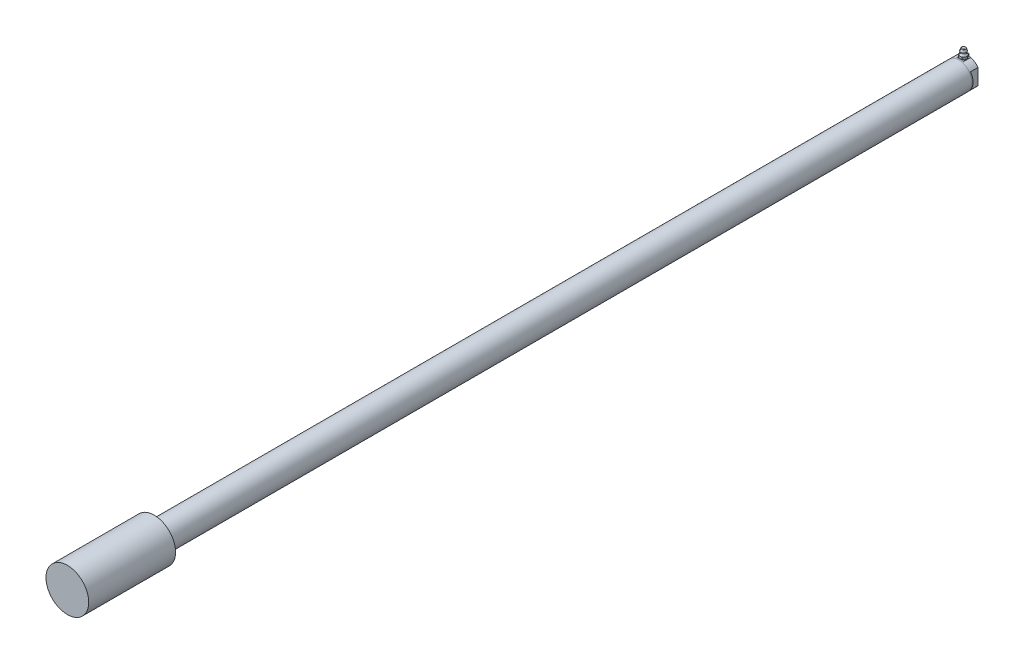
ISO-10303-21;
HEADER;
FILE_DESCRIPTION(('STEP AP214'),'2;1');
FILE_NAME('part.step','',(''),(''),'','','');
FILE_SCHEMA(('AUTOMOTIVE_DESIGN { 1 0 10303 214 1 1 1 1 }'));
ENDSEC;
DATA;
#1=APPLICATION_CONTEXT('core data for automotive mechanical design processes');
#2=APPLICATION_PROTOCOL_DEFINITION('international standard','automotive_design',2000,#1);
#3=PRODUCT_CONTEXT('',#1,'mechanical');
#4=PRODUCT('Part','Part','',(#3));
#5=PRODUCT_RELATED_PRODUCT_CATEGORY('part','',(#4));
#6=PRODUCT_DEFINITION_FORMATION('','',#4);
#7=PRODUCT_DEFINITION_CONTEXT('part definition',#1,'design');
#8=PRODUCT_DEFINITION('design','',#6,#7);
#9=PRODUCT_DEFINITION_SHAPE('','',#8);
#10=(LENGTH_UNIT() NAMED_UNIT(*) SI_UNIT(.MILLI.,.METRE.));
#11=(NAMED_UNIT(*) PLANE_ANGLE_UNIT() SI_UNIT($,.RADIAN.));
#12=(NAMED_UNIT(*) SI_UNIT($,.STERADIAN.) SOLID_ANGLE_UNIT());
#13=UNCERTAINTY_MEASURE_WITH_UNIT(LENGTH_MEASURE(1.E-05),#10,'distance_accuracy_value','');
#14=(GEOMETRIC_REPRESENTATION_CONTEXT(3) GLOBAL_UNCERTAINTY_ASSIGNED_CONTEXT((#13)) GLOBAL_UNIT_ASSIGNED_CONTEXT((#10,
#11,#12)) REPRESENTATION_CONTEXT('',''));
#15=CARTESIAN_POINT('',(0.,0.,0.));
#16=DIRECTION('',(0.,0.,1.));
#17=DIRECTION('',(1.,0.,0.));
#18=AXIS2_PLACEMENT_3D('',#15,#16,#17);
#19=CARTESIAN_POINT('',(0.,0.,10.16));
#20=DIRECTION('',(0.,0.,-1.));
#21=DIRECTION('',(-1.,0.,0.));
#22=AXIS2_PLACEMENT_3D('',#19,#20,#21);
#23=PLANE('',#22);
#24=CARTESIAN_POINT('',(0.,9.525,10.16));
#25=DIRECTION('',(0.,0.,-1.));
#26=DIRECTION('',(-1.,0.,0.));
#27=AXIS2_PLACEMENT_3D('',#24,#25,#26);
#28=CIRCLE('',#27,0.79375);
#29=CARTESIAN_POINT('',(-0.793749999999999,9.525,10.16));
#30=VERTEX_POINT('',#29);
#31=EDGE_CURVE('E26',#30,#30,#28,.T.);
#32=ORIENTED_EDGE('',*,*,#31,.T.);
#33=EDGE_LOOP('',(#32));
#34=FACE_BOUND('',#33,.T.);
#35=ADVANCED_FACE('F16',(#34),#23,.T.);
#36=CARTESIAN_POINT('',(0.,0.,979.1446));
#37=DIRECTION('',(0.,0.,-1.));
#38=DIRECTION('',(-1.,0.,0.));
#39=AXIS2_PLACEMENT_3D('',#36,#37,#38);
#40=CYLINDRICAL_SURFACE('',#39,15.8496);
#41=CARTESIAN_POINT('',(0.,0.,966.6986));
#42=DIRECTION('',(0.,0.,-1.));
#43=DIRECTION('',(-1.,0.,0.));
#44=AXIS2_PLACEMENT_3D('',#41,#42,#43);
#45=CIRCLE('',#44,15.8496);
#46=CARTESIAN_POINT('',(-15.8496,0.,966.6986));
#47=VERTEX_POINT('',#46);
#48=EDGE_CURVE('E433',#47,#47,#45,.F.);
#49=ORIENTED_EDGE('',*,*,#48,.F.);
#50=EDGE_LOOP('',(#49));
#51=FACE_BOUND('',#50,.T.);
#52=CARTESIAN_POINT('',(0.,0.,10.16));
#53=DIRECTION('',(0.,0.,-1.));
#54=DIRECTION('',(-1.,0.,0.));
#55=AXIS2_PLACEMENT_3D('',#52,#53,#54);
#56=CIRCLE('',#55,15.8496);
#57=CARTESIAN_POINT('',(-15.8496,0.,10.16));
#58=VERTEX_POINT('',#57);
#59=EDGE_CURVE('E436',#58,#58,#56,.T.);
#60=ORIENTED_EDGE('',*,*,#59,.F.);
#61=EDGE_LOOP('',(#60));
#62=FACE_BOUND('',#61,.T.);
#63=ADVANCED_FACE('F236',(#51,#62),#40,.T.);
#64=CARTESIAN_POINT('',(0.,0.,10.16));
#65=DIRECTION('',(0.,0.,-1.));
#66=DIRECTION('',(-1.,0.,0.));
#67=AXIS2_PLACEMENT_3D('',#64,#65,#66);
#68=CIRCLE('',#67,15.7607);
#69=CARTESIAN_POINT('',(-15.7607,0.,10.16));
#70=VERTEX_POINT('',#69);
#71=EDGE_CURVE('E10',#70,#70,#68,.T.);
#72=ORIENTED_EDGE('',*,*,#71,.F.);
#73=EDGE_LOOP('',(#72));
#74=FACE_BOUND('',#73,.T.);
#75=ORIENTED_EDGE('',*,*,#59,.T.);
#76=EDGE_LOOP('',(#75));
#77=FACE_BOUND('',#76,.T.);
#78=ADVANCED_FACE('F239',(#74,#77),#23,.T.);
#79=CARTESIAN_POINT('',(0.,0.,966.6986));
#80=DIRECTION('',(0.,0.,-1.));
#81=DIRECTION('',(-1.,0.,0.));
#82=AXIS2_PLACEMENT_3D('',#79,#80,#81);
#83=PLANE('',#82);
#84=ORIENTED_EDGE('',*,*,#48,.T.);
#85=EDGE_LOOP('',(#84));
#86=FACE_BOUND('',#85,.T.);
#87=CARTESIAN_POINT('',(0.,0.,966.6986));
#88=DIRECTION('',(0.,0.,-1.));
#89=DIRECTION('',(-1.,0.,0.));
#90=AXIS2_PLACEMENT_3D('',#87,#88,#89);
#91=CIRCLE('',#90,25.4);
#92=CARTESIAN_POINT('',(-25.4,0.,966.6986));
#93=VERTEX_POINT('',#92);
#94=EDGE_CURVE('E358',#93,#93,#91,.T.);
#95=ORIENTED_EDGE('',*,*,#94,.T.);
#96=EDGE_LOOP('',(#95));
#97=FACE_BOUND('',#96,.T.);
#98=ADVANCED_FACE('F249',(#86,#97),#83,.T.);
#99=CARTESIAN_POINT('',(0.,0.,1069.9496));
#100=DIRECTION('',(0.,0.,1.));
#101=DIRECTION('',(1.,0.,0.));
#102=AXIS2_PLACEMENT_3D('',#99,#100,#101);
#103=PLANE('',#102);
#104=CARTESIAN_POINT('',(0.,0.,1069.9496));
#105=DIRECTION('',(0.,0.,1.));
#106=DIRECTION('',(1.,0.,0.));
#107=AXIS2_PLACEMENT_3D('',#104,#105,#106);
#108=CIRCLE('',#107,25.4);
#109=CARTESIAN_POINT('',(25.4,0.,1069.9496));
#110=VERTEX_POINT('',#109);
#111=EDGE_CURVE('E439',#110,#110,#108,.T.);
#112=ORIENTED_EDGE('',*,*,#111,.T.);
#113=EDGE_LOOP('',(#112));
#114=FACE_BOUND('',#113,.T.);
#115=ADVANCED_FACE('F449',(#114),#103,.T.);
#116=CARTESIAN_POINT('',(0.,0.,1069.9496));
#117=DIRECTION('',(0.,0.,-1.));
#118=DIRECTION('',(-1.,0.,0.));
#119=AXIS2_PLACEMENT_3D('',#116,#117,#118);
#120=CYLINDRICAL_SURFACE('',#119,25.4);
#121=ORIENTED_EDGE('',*,*,#111,.F.);
#122=EDGE_LOOP('',(#121));
#123=FACE_BOUND('',#122,.T.);
#124=ORIENTED_EDGE('',*,*,#94,.F.);
#125=EDGE_LOOP('',(#124));
#126=FACE_BOUND('',#125,.T.);
#127=ADVANCED_FACE('F446',(#123,#126),#120,.T.);
#128=CARTESIAN_POINT('',(0.,25.4,4.445));
#129=DIRECTION('',(0.,1.,0.));
#130=DIRECTION('',(0.,0.,1.));
#131=AXIS2_PLACEMENT_3D('',#128,#129,#130);
#132=PLANE('',#131);
#133=CARTESIAN_POINT('',(0.,25.4,4.445));
#134=DIRECTION('',(0.,1.,0.));
#135=DIRECTION('',(0.,0.,1.));
#136=AXIS2_PLACEMENT_3D('',#133,#134,#135);
#137=CIRCLE('',#136,1.7474960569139);
#138=CARTESIAN_POINT('',(0.,25.4,6.1924960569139));
#139=VERTEX_POINT('',#138);
#140=EDGE_CURVE('E20',#139,#139,#137,.T.);
#141=ORIENTED_EDGE('',*,*,#140,.T.);
#142=EDGE_LOOP('',(#141));
#143=FACE_BOUND('',#142,.T.);
#144=ADVANCED_FACE('F448',(#143),#132,.T.);
#145=CARTESIAN_POINT('',(0.,24.638,4.445));
#146=DIRECTION('',(0.,1.,0.));
#147=DIRECTION('',(0.,0.,1.));
#148=AXIS2_PLACEMENT_3D('',#145,#146,#147);
#149=TOROIDAL_SURFACE('',#148,1.7474960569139,0.762);
#150=ORIENTED_EDGE('',*,*,#140,.F.);
#151=EDGE_LOOP('',(#150));
#152=FACE_BOUND('',#151,.T.);
#153=CARTESIAN_POINT('',(0.,24.8923915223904,4.445));
#154=DIRECTION('',(0.,1.,0.));
#155=DIRECTION('',(0.,0.,1.));
#156=AXIS2_PLACEMENT_3D('',#153,#154,#155);
#157=CIRCLE('',#156,2.46577800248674);
#158=CARTESIAN_POINT('',(0.,24.8923915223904,6.91077800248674));
#159=VERTEX_POINT('',#158);
#160=EDGE_CURVE('E423',#159,#159,#157,.F.);
#161=ORIENTED_EDGE('',*,*,#160,.F.);
#162=EDGE_LOOP('',(#161));
#163=FACE_BOUND('',#162,.T.);
#164=ADVANCED_FACE('F18',(#152,#163),#149,.T.);
#165=CARTESIAN_POINT('',(0.,22.352,4.445));
#166=DIRECTION('',(0.,-1.,0.));
#167=DIRECTION('',(0.,0.,-1.));
#168=AXIS2_PLACEMENT_3D('',#165,#166,#167);
#169=CONICAL_SURFACE('',#168,3.3655,0.340381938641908);
#170=ORIENTED_EDGE('',*,*,#160,.T.);
#171=EDGE_LOOP('',(#170));
#172=FACE_BOUND('',#171,.T.);
#173=CARTESIAN_POINT('',(0.,22.352,4.445));
#174=DIRECTION('',(0.,-1.,0.));
#175=DIRECTION('',(0.,0.,-1.));
#176=AXIS2_PLACEMENT_3D('',#173,#174,#175);
#177=CIRCLE('',#176,3.3655);
#178=CARTESIAN_POINT('',(0.,22.352,1.0795));
#179=VERTEX_POINT('',#178);
#180=EDGE_CURVE('E361',#179,#179,#177,.T.);
#181=ORIENTED_EDGE('',*,*,#180,.F.);
#182=EDGE_LOOP('',(#181));
#183=FACE_BOUND('',#182,.T.);
#184=ADVANCED_FACE('F266',(#172,#183),#169,.T.);
#185=CARTESIAN_POINT('',(0.,20.7536902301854,4.445));
#186=DIRECTION('',(0.,-1.,0.));
#187=DIRECTION('',(0.,0.,-1.));
#188=AXIS2_PLACEMENT_3D('',#185,#186,#187);
#189=TOROIDAL_SURFACE('',#188,5.20693450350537,2.43833450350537);
#190=ORIENTED_EDGE('',*,*,#180,.T.);
#191=EDGE_LOOP('',(#190));
#192=FACE_BOUND('',#191,.T.);
#193=CARTESIAN_POINT('',(0.,18.653125,4.445));
#194=DIRECTION('',(0.,-1.,0.));
#195=DIRECTION('',(0.,0.,-1.));
#196=AXIS2_PLACEMENT_3D('',#193,#194,#195);
#197=CIRCLE('',#196,3.96875);
#198=CARTESIAN_POINT('',(0.,18.653125,0.47625));
#199=VERTEX_POINT('',#198);
#200=CARTESIAN_POINT('',(3.43703832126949,18.653125,2.460625));
#201=VERTEX_POINT('',#200);
#202=EDGE_CURVE('E101',#199,#201,#197,.T.);
#203=ORIENTED_EDGE('',*,*,#202,.F.);
#204=CARTESIAN_POINT('',(-3.43703832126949,18.653125,2.460625));
#205=VERTEX_POINT('',#204);
#206=EDGE_CURVE('E364',#205,#199,#197,.T.);
#207=ORIENTED_EDGE('',*,*,#206,.F.);
#208=CARTESIAN_POINT('',(-3.43703832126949,18.653125,6.429375));
#209=VERTEX_POINT('',#208);
#210=EDGE_CURVE('E839',#209,#205,#197,.T.);
#211=ORIENTED_EDGE('',*,*,#210,.F.);
#212=CARTESIAN_POINT('',(0.,18.653125,8.41375));
#213=VERTEX_POINT('',#212);
#214=EDGE_CURVE('E836',#213,#209,#197,.T.);
#215=ORIENTED_EDGE('',*,*,#214,.F.);
#216=CARTESIAN_POINT('',(3.43703832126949,18.653125,6.429375));
#217=VERTEX_POINT('',#216);
#218=EDGE_CURVE('E835',#217,#213,#197,.T.);
#219=ORIENTED_EDGE('',*,*,#218,.F.);
#220=EDGE_CURVE('E94',#201,#217,#197,.T.);
#221=ORIENTED_EDGE('',*,*,#220,.F.);
#222=EDGE_LOOP('',(#203,#207,#211,#215,#219,#221));
#223=FACE_BOUND('',#222,.T.);
#224=ADVANCED_FACE('F457',(#192,#223),#189,.F.);
#225=CARTESIAN_POINT('',(-2.29135888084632,18.653125,0.47625));
#226=DIRECTION('',(0.,1.,0.));
#227=DIRECTION('',(1.,0.,0.));
#228=AXIS2_PLACEMENT_3D('',#225,#226,#227);
#229=PLANE('',#228);
#230=ORIENTED_EDGE('',*,*,#210,.T.);
#231=DIRECTION('',(-0.5,0.,0.866025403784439));
#232=VECTOR('',#231,1.);
#233=CARTESIAN_POINT('',(-2.29135888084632,18.653125,0.47625));
#234=LINE('',#233,#232);
#235=CARTESIAN_POINT('',(-4.58271776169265,18.653125,4.445));
#236=VERTEX_POINT('',#235);
#237=EDGE_CURVE('E375',#205,#236,#234,.T.);
#238=ORIENTED_EDGE('',*,*,#237,.T.);
#239=DIRECTION('',(0.5,0.,0.866025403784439));
#240=VECTOR('',#239,1.);
#241=CARTESIAN_POINT('',(-4.58271776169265,18.653125,4.445));
#242=LINE('',#241,#240);
#243=EDGE_CURVE('E381',#236,#209,#242,.T.);
#244=ORIENTED_EDGE('',*,*,#243,.T.);
#245=EDGE_LOOP('',(#230,#238,#244));
#246=FACE_BOUND('',#245,.T.);
#247=ADVANCED_FACE('F650',(#246),#229,.T.);
#248=ORIENTED_EDGE('',*,*,#214,.T.);
#249=CARTESIAN_POINT('',(-2.29135888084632,18.653125,8.41375));
#250=VERTEX_POINT('',#249);
#251=EDGE_CURVE('E380',#209,#250,#242,.T.);
#252=ORIENTED_EDGE('',*,*,#251,.T.);
#253=DIRECTION('',(1.,0.,0.));
#254=VECTOR('',#253,1.);
#255=CARTESIAN_POINT('',(-2.29135888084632,18.653125,8.41375));
#256=LINE('',#255,#254);
#257=EDGE_CURVE('E384',#250,#213,#256,.T.);
#258=ORIENTED_EDGE('',*,*,#257,.T.);
#259=EDGE_LOOP('',(#248,#252,#258));
#260=FACE_BOUND('',#259,.T.);
#261=ADVANCED_FACE('F262',(#260),#229,.T.);
#262=ORIENTED_EDGE('',*,*,#218,.T.);
#263=CARTESIAN_POINT('',(2.29135888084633,18.653125,8.41375));
#264=VERTEX_POINT('',#263);
#265=EDGE_CURVE('E383',#213,#264,#256,.T.);
#266=ORIENTED_EDGE('',*,*,#265,.T.);
#267=DIRECTION('',(0.5,0.,-0.866025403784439));
#268=VECTOR('',#267,1.);
#269=CARTESIAN_POINT('',(2.29135888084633,18.653125,8.41375));
#270=LINE('',#269,#268);
#271=EDGE_CURVE('E388',#264,#217,#270,.T.);
#272=ORIENTED_EDGE('',*,*,#271,.T.);
#273=EDGE_LOOP('',(#262,#266,#272));
#274=FACE_BOUND('',#273,.T.);
#275=ADVANCED_FACE('F726',(#274),#229,.T.);
#276=ORIENTED_EDGE('',*,*,#220,.T.);
#277=CARTESIAN_POINT('',(4.58271776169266,18.653125,4.445));
#278=VERTEX_POINT('',#277);
#279=EDGE_CURVE('E387',#217,#278,#270,.T.);
#280=ORIENTED_EDGE('',*,*,#279,.T.);
#281=DIRECTION('',(-0.5,0.,-0.866025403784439));
#282=VECTOR('',#281,1.);
#283=CARTESIAN_POINT('',(4.58271776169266,18.653125,4.445));
#284=LINE('',#283,#282);
#285=EDGE_CURVE('E392',#278,#201,#284,.T.);
#286=ORIENTED_EDGE('',*,*,#285,.T.);
#287=EDGE_LOOP('',(#276,#280,#286));
#288=FACE_BOUND('',#287,.T.);
#289=ADVANCED_FACE('F719',(#288),#229,.T.);
#290=ORIENTED_EDGE('',*,*,#202,.T.);
#291=CARTESIAN_POINT('',(2.29135888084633,18.653125,0.47625));
#292=VERTEX_POINT('',#291);
#293=EDGE_CURVE('E391',#201,#292,#284,.T.);
#294=ORIENTED_EDGE('',*,*,#293,.T.);
#295=DIRECTION('',(-1.,0.,0.));
#296=VECTOR('',#295,1.);
#297=CARTESIAN_POINT('',(2.29135888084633,18.653125,0.47625));
#298=LINE('',#297,#296);
#299=EDGE_CURVE('E373',#292,#199,#298,.T.);
#300=ORIENTED_EDGE('',*,*,#299,.T.);
#301=EDGE_LOOP('',(#290,#294,#300));
#302=FACE_BOUND('',#301,.T.);
#303=ADVANCED_FACE('F710',(#302),#229,.T.);
#304=ORIENTED_EDGE('',*,*,#206,.T.);
#305=CARTESIAN_POINT('',(-2.29135888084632,18.653125,0.47625));
#306=VERTEX_POINT('',#305);
#307=EDGE_CURVE('E376',#199,#306,#298,.T.);
#308=ORIENTED_EDGE('',*,*,#307,.T.);
#309=EDGE_CURVE('E377',#306,#205,#234,.T.);
#310=ORIENTED_EDGE('',*,*,#309,.T.);
#311=EDGE_LOOP('',(#304,#308,#310));
#312=FACE_BOUND('',#311,.T.);
#313=ADVANCED_FACE('F660',(#312),#229,.T.);
#314=CARTESIAN_POINT('',(-2.29135888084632,18.653125,0.47625));
#315=DIRECTION('',(0.866025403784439,0.,0.5));
#316=DIRECTION('',(0.5,0.,-0.866025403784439));
#317=AXIS2_PLACEMENT_3D('',#314,#315,#316);
#318=PLANE('',#317);
#319=DIRECTION('',(-0.5,0.,0.866025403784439));
#320=VECTOR('',#319,1.);
#321=CARTESIAN_POINT('',(-2.29135888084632,16.271875,0.47625));
#322=LINE('',#321,#320);
#323=CARTESIAN_POINT('',(-2.29135888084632,16.271875,0.47625));
#324=VERTEX_POINT('',#323);
#325=CARTESIAN_POINT('',(-4.58271776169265,16.271875,4.445));
#326=VERTEX_POINT('',#325);
#327=EDGE_CURVE('E397',#324,#326,#322,.T.);
#328=ORIENTED_EDGE('',*,*,#327,.T.);
#329=DIRECTION('',(0.,-1.,0.));
#330=VECTOR('',#329,1.);
#331=CARTESIAN_POINT('',(-4.58271776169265,18.653125,4.445));
#332=LINE('',#331,#330);
#333=EDGE_CURVE('E418',#236,#326,#332,.T.);
#334=ORIENTED_EDGE('',*,*,#333,.F.);
#335=ORIENTED_EDGE('',*,*,#237,.F.);
#336=ORIENTED_EDGE('',*,*,#309,.F.);
#337=DIRECTION('',(0.,-1.,0.));
#338=VECTOR('',#337,1.);
#339=CARTESIAN_POINT('',(-2.29135888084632,18.653125,0.47625));
#340=LINE('',#339,#338);
#341=EDGE_CURVE('E421',#306,#324,#340,.T.);
#342=ORIENTED_EDGE('',*,*,#341,.T.);
#343=EDGE_LOOP('',(#328,#334,#335,#336,#342));
#344=FACE_BOUND('',#343,.T.);
#345=ADVANCED_FACE('F659',(#344),#318,.F.);
#346=CARTESIAN_POINT('',(-4.58271776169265,18.653125,4.445));
#347=DIRECTION('',(0.866025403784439,0.,-0.5));
#348=DIRECTION('',(-0.5,0.,-0.866025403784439));
#349=AXIS2_PLACEMENT_3D('',#346,#347,#348);
#350=PLANE('',#349);
#351=DIRECTION('',(0.5,0.,0.866025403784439));
#352=VECTOR('',#351,1.);
#353=CARTESIAN_POINT('',(-4.58271776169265,16.271875,4.445));
#354=LINE('',#353,#352);
#355=CARTESIAN_POINT('',(-2.29135888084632,16.271875,8.41375));
#356=VERTEX_POINT('',#355);
#357=EDGE_CURVE('E399',#326,#356,#354,.T.);
#358=ORIENTED_EDGE('',*,*,#357,.T.);
#359=DIRECTION('',(0.,-1.,0.));
#360=VECTOR('',#359,1.);
#361=CARTESIAN_POINT('',(-2.29135888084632,18.653125,8.41375));
#362=LINE('',#361,#360);
#363=EDGE_CURVE('E415',#250,#356,#362,.T.);
#364=ORIENTED_EDGE('',*,*,#363,.F.);
#365=ORIENTED_EDGE('',*,*,#251,.F.);
#366=ORIENTED_EDGE('',*,*,#243,.F.);
#367=ORIENTED_EDGE('',*,*,#333,.T.);
#368=EDGE_LOOP('',(#358,#364,#365,#366,#367));
#369=FACE_BOUND('',#368,.T.);
#370=ADVANCED_FACE('F685',(#369),#350,.F.);
#371=CARTESIAN_POINT('',(-2.29135888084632,18.653125,8.41375));
#372=DIRECTION('',(0.,0.,-1.));
#373=DIRECTION('',(-1.,0.,0.));
#374=AXIS2_PLACEMENT_3D('',#371,#372,#373);
#375=PLANE('',#374);
#376=DIRECTION('',(1.,0.,0.));
#377=VECTOR('',#376,1.);
#378=CARTESIAN_POINT('',(-2.29135888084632,16.271875,8.41375));
#379=LINE('',#378,#377);
#380=CARTESIAN_POINT('',(2.29135888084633,16.271875,8.41375));
#381=VERTEX_POINT('',#380);
#382=EDGE_CURVE('E401',#356,#381,#379,.T.);
#383=ORIENTED_EDGE('',*,*,#382,.T.);
#384=DIRECTION('',(0.,-1.,0.));
#385=VECTOR('',#384,1.);
#386=CARTESIAN_POINT('',(2.29135888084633,18.653125,8.41375));
#387=LINE('',#386,#385);
#388=EDGE_CURVE('E412',#264,#381,#387,.T.);
#389=ORIENTED_EDGE('',*,*,#388,.F.);
#390=ORIENTED_EDGE('',*,*,#265,.F.);
#391=ORIENTED_EDGE('',*,*,#257,.F.);
#392=ORIENTED_EDGE('',*,*,#363,.T.);
#393=EDGE_LOOP('',(#383,#389,#390,#391,#392));
#394=FACE_BOUND('',#393,.T.);
#395=ADVANCED_FACE('F676',(#394),#375,.F.);
#396=CARTESIAN_POINT('',(2.29135888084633,18.653125,8.41375));
#397=DIRECTION('',(-0.866025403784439,0.,-0.5));
#398=DIRECTION('',(-0.5,0.,0.866025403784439));
#399=AXIS2_PLACEMENT_3D('',#396,#397,#398);
#400=PLANE('',#399);
#401=DIRECTION('',(0.5,0.,-0.866025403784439));
#402=VECTOR('',#401,1.);
#403=CARTESIAN_POINT('',(2.29135888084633,16.271875,8.41375));
#404=LINE('',#403,#402);
#405=CARTESIAN_POINT('',(4.58271776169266,16.271875,4.445));
#406=VERTEX_POINT('',#405);
#407=EDGE_CURVE('E403',#381,#406,#404,.T.);
#408=ORIENTED_EDGE('',*,*,#407,.T.);
#409=DIRECTION('',(0.,-1.,0.));
#410=VECTOR('',#409,1.);
#411=CARTESIAN_POINT('',(4.58271776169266,18.653125,4.445));
#412=LINE('',#411,#410);
#413=EDGE_CURVE('E409',#278,#406,#412,.T.);
#414=ORIENTED_EDGE('',*,*,#413,.F.);
#415=ORIENTED_EDGE('',*,*,#279,.F.);
#416=ORIENTED_EDGE('',*,*,#271,.F.);
#417=ORIENTED_EDGE('',*,*,#388,.T.);
#418=EDGE_LOOP('',(#408,#414,#415,#416,#417));
#419=FACE_BOUND('',#418,.T.);
#420=ADVANCED_FACE('F667',(#419),#400,.F.);
#421=CARTESIAN_POINT('',(4.58271776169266,18.653125,4.445));
#422=DIRECTION('',(-0.866025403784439,0.,0.5));
#423=DIRECTION('',(0.5,0.,0.866025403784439));
#424=AXIS2_PLACEMENT_3D('',#421,#422,#423);
#425=PLANE('',#424);
#426=DIRECTION('',(-0.5,0.,-0.866025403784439));
#427=VECTOR('',#426,1.);
#428=CARTESIAN_POINT('',(4.58271776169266,16.271875,4.445));
#429=LINE('',#428,#427);
#430=CARTESIAN_POINT('',(2.29135888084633,16.271875,0.47625));
#431=VERTEX_POINT('',#430);
#432=EDGE_CURVE('E405',#406,#431,#429,.T.);
#433=ORIENTED_EDGE('',*,*,#432,.T.);
#434=DIRECTION('',(0.,-1.,0.));
#435=VECTOR('',#434,1.);
#436=CARTESIAN_POINT('',(2.29135888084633,18.653125,0.47625));
#437=LINE('',#436,#435);
#438=EDGE_CURVE('E394',#292,#431,#437,.T.);
#439=ORIENTED_EDGE('',*,*,#438,.F.);
#440=ORIENTED_EDGE('',*,*,#293,.F.);
#441=ORIENTED_EDGE('',*,*,#285,.F.);
#442=ORIENTED_EDGE('',*,*,#413,.T.);
#443=EDGE_LOOP('',(#433,#439,#440,#441,#442));
#444=FACE_BOUND('',#443,.T.);
#445=ADVANCED_FACE('F657',(#444),#425,.F.);
#446=CARTESIAN_POINT('',(2.29135888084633,18.653125,0.47625));
#447=DIRECTION('',(0.,0.,1.));
#448=DIRECTION('',(0.,-1.,0.));
#449=AXIS2_PLACEMENT_3D('',#446,#447,#448);
#450=PLANE('',#449);
#451=DIRECTION('',(-1.,0.,0.));
#452=VECTOR('',#451,1.);
#453=CARTESIAN_POINT('',(2.29135888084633,16.271875,0.47625));
#454=LINE('',#453,#452);
#455=EDGE_CURVE('E372',#431,#324,#454,.T.);
#456=ORIENTED_EDGE('',*,*,#455,.T.);
#457=ORIENTED_EDGE('',*,*,#341,.F.);
#458=ORIENTED_EDGE('',*,*,#307,.F.);
#459=ORIENTED_EDGE('',*,*,#299,.F.);
#460=ORIENTED_EDGE('',*,*,#438,.T.);
#461=EDGE_LOOP('',(#456,#457,#458,#459,#460));
#462=FACE_BOUND('',#461,.T.);
#463=ADVANCED_FACE('F647',(#462),#450,.F.);
#464=CARTESIAN_POINT('',(-2.29135888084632,16.271875,0.47625));
#465=DIRECTION('',(0.,1.,0.));
#466=DIRECTION('',(1.,0.,0.));
#467=AXIS2_PLACEMENT_3D('',#464,#465,#466);
#468=PLANE('',#467);
#469=CARTESIAN_POINT('',(0.,16.271875,4.445));
#470=DIRECTION('',(0.,-1.,0.));
#471=DIRECTION('',(0.,0.,-1.));
#472=AXIS2_PLACEMENT_3D('',#469,#470,#471);
#473=CIRCLE('',#472,3.2385);
#474=CARTESIAN_POINT('',(0.,16.271875,1.2065));
#475=VERTEX_POINT('',#474);
#476=EDGE_CURVE('E366',#475,#475,#473,.T.);
#477=ORIENTED_EDGE('',*,*,#476,.F.);
#478=EDGE_LOOP('',(#477));
#479=FACE_BOUND('',#478,.T.);
#480=ORIENTED_EDGE('',*,*,#455,.F.);
#481=ORIENTED_EDGE('',*,*,#432,.F.);
#482=ORIENTED_EDGE('',*,*,#407,.F.);
#483=ORIENTED_EDGE('',*,*,#382,.F.);
#484=ORIENTED_EDGE('',*,*,#357,.F.);
#485=ORIENTED_EDGE('',*,*,#327,.F.);
#486=EDGE_LOOP('',(#480,#481,#482,#483,#484,#485));
#487=FACE_BOUND('',#486,.T.);
#488=ADVANCED_FACE('F263',(#479,#487),#468,.F.);
#489=CARTESIAN_POINT('',(0.,16.271875,4.445));
#490=DIRECTION('',(0.,-1.,0.));
#491=DIRECTION('',(0.,0.,-1.));
#492=AXIS2_PLACEMENT_3D('',#489,#490,#491);
#493=CYLINDRICAL_SURFACE('',#492,3.2385);
#494=ORIENTED_EDGE('',*,*,#476,.T.);
#495=EDGE_LOOP('',(#494));
#496=FACE_BOUND('',#495,.T.);
#497=CARTESIAN_POINT('',(0.,15.763875,4.445));
#498=DIRECTION('',(0.,-1.,0.));
#499=DIRECTION('',(0.,0.,-1.));
#500=AXIS2_PLACEMENT_3D('',#497,#498,#499);
#501=CIRCLE('',#500,3.2385);
#502=CARTESIAN_POINT('',(0.,15.763875,1.2065));
#503=VERTEX_POINT('',#502);
#504=EDGE_CURVE('E369',#503,#503,#501,.T.);
#505=ORIENTED_EDGE('',*,*,#504,.F.);
#506=EDGE_LOOP('',(#505));
#507=FACE_BOUND('',#506,.T.);
#508=ADVANCED_FACE('F253',(#496,#507),#493,.T.);
#509=CARTESIAN_POINT('',(0.,0.,33.0708));
#510=DIRECTION('',(0.,0.,-1.));
#511=DIRECTION('',(0.,1.,0.));
#512=AXIS2_PLACEMENT_3D('',#509,#510,#511);
#513=CONICAL_SURFACE('',#512,7.25,1.02974425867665);
#514=CARTESIAN_POINT('',(0.,0.,37.4270394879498));
#515=VERTEX_POINT('',#514);
#516=VERTEX_LOOP('',#515);
#517=FACE_BOUND('',#516,.T.);
#518=CARTESIAN_POINT('',(0.,0.,33.0708));
#519=DIRECTION('',(0.,0.,-1.));
#520=DIRECTION('',(0.,1.,0.));
#521=AXIS2_PLACEMENT_3D('',#518,#519,#520);
#522=CIRCLE('',#521,7.25);
#523=CARTESIAN_POINT('',(0.,7.25,33.0708));
#524=VERTEX_POINT('',#523);
#525=EDGE_CURVE('E312',#524,#524,#522,.T.);
#526=ORIENTED_EDGE('',*,*,#525,.T.);
#527=EDGE_LOOP('',(#526));
#528=FACE_BOUND('',#527,.T.);
#529=ADVANCED_FACE('F212',(#517,#528),#513,.F.);
#530=CARTESIAN_POINT('',(0.,11.509375,4.445));
#531=DIRECTION('',(0.,1.,0.));
#532=DIRECTION('',(0.,0.,1.));
#533=AXIS2_PLACEMENT_3D('',#530,#531,#532);
#534=CONICAL_SURFACE('',#533,3.048,0.0447462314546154);
#535=ORIENTED_EDGE('',*,*,#504,.T.);
#536=EDGE_LOOP('',(#535));
#537=FACE_BOUND('',#536,.T.);
#538=CARTESIAN_POINT('',(0.,15.24,4.445));
#539=DIRECTION('',(0.,-1.,0.));
#540=DIRECTION('',(1.,0.,0.));
#541=AXIS2_PLACEMENT_3D('',#538,#539,#540);
#542=CIRCLE('',#541,3.21504291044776);
#543=CARTESIAN_POINT('',(3.21504291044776,15.24,4.445));
#544=VERTEX_POINT('',#543);
#545=EDGE_CURVE('E355',#544,#544,#542,.T.);
#546=ORIENTED_EDGE('',*,*,#545,.F.);
#547=EDGE_LOOP('',(#546));
#548=FACE_BOUND('',#547,.T.);
#549=ADVANCED_FACE('F252',(#537,#548),#534,.T.);
#550=CARTESIAN_POINT('',(0.,11.509375,1.397));
#551=DIRECTION('',(0.,-1.,0.));
#552=DIRECTION('',(0.,0.,-1.));
#553=AXIS2_PLACEMENT_3D('',#550,#551,#552);
#554=PLANE('',#553);
#555=CARTESIAN_POINT('',(0.,11.509375,4.445));
#556=DIRECTION('',(0.,-1.,0.));
#557=DIRECTION('',(0.,0.,-1.));
#558=AXIS2_PLACEMENT_3D('',#555,#556,#557);
#559=CIRCLE('',#558,2.54);
#560=CARTESIAN_POINT('',(0.,11.509375,1.905));
#561=VERTEX_POINT('',#560);
#562=EDGE_CURVE('E353',#561,#561,#559,.F.);
#563=ORIENTED_EDGE('',*,*,#562,.F.);
#564=EDGE_LOOP('',(#563));
#565=FACE_BOUND('',#564,.T.);
#566=ADVANCED_FACE('F225',(#565),#554,.T.);
#567=CARTESIAN_POINT('',(0.,0.,0.));
#568=DIRECTION('',(0.,0.,-1.));
#569=DIRECTION('',(0.,1.,0.));
#570=AXIS2_PLACEMENT_3D('',#567,#568,#569);
#571=CYLINDRICAL_SURFACE('',#570,7.25);
#572=ORIENTED_EDGE('',*,*,#525,.F.);
#573=EDGE_LOOP('',(#572));
#574=FACE_BOUND('',#573,.T.);
#575=CARTESIAN_POINT('',(0.,0.,0.));
#576=DIRECTION('',(0.,0.,-1.));
#577=DIRECTION('',(0.,1.,0.));
#578=AXIS2_PLACEMENT_3D('',#575,#576,#577);
#579=CIRCLE('',#578,7.25);
#580=CARTESIAN_POINT('',(0.,7.25,0.));
#581=VERTEX_POINT('',#580);
#582=EDGE_CURVE('E306',#581,#581,#579,.T.);
#583=ORIENTED_EDGE('',*,*,#582,.T.);
#584=EDGE_LOOP('',(#583));
#585=FACE_BOUND('',#584,.T.);
#586=ADVANCED_FACE('F269',(#574,#585),#571,.F.);
#587=CARTESIAN_POINT('',(0.,0.,8.89));
#588=DIRECTION('',(0.,0.,-1.));
#589=DIRECTION('',(0.,1.,0.));
#590=AXIS2_PLACEMENT_3D('',#587,#588,#589);
#591=PLANE('',#590);
#592=CARTESIAN_POINT('',(0.,0.,8.89));
#593=DIRECTION('',(0.,0.,-1.));
#594=DIRECTION('',(0.,1.,0.));
#595=AXIS2_PLACEMENT_3D('',#592,#593,#594);
#596=CIRCLE('',#595,15.7607);
#597=CARTESIAN_POINT('',(12.7,9.33325583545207,8.89));
#598=VERTEX_POINT('',#597);
#599=CARTESIAN_POINT('',(12.7,-9.33325583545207,8.89));
#600=VERTEX_POINT('',#599);
#601=EDGE_CURVE('E335',#598,#600,#596,.T.);
#602=ORIENTED_EDGE('',*,*,#601,.T.);
#603=DIRECTION('',(0.,1.,0.));
#604=VECTOR('',#603,1.);
#605=CARTESIAN_POINT('',(12.7,-9.33325583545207,8.89));
#606=LINE('',#605,#604);
#607=EDGE_CURVE('E337',#600,#598,#606,.T.);
#608=ORIENTED_EDGE('',*,*,#607,.T.);
#609=EDGE_LOOP('',(#602,#608));
#610=FACE_BOUND('',#609,.T.);
#611=ADVANCED_FACE('F254',(#610),#591,.T.);
#612=CARTESIAN_POINT('',(12.7,-9.33325583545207,8.89));
#613=DIRECTION('',(-1.,0.,0.));
#614=DIRECTION('',(0.,0.,1.));
#615=AXIS2_PLACEMENT_3D('',#612,#613,#614);
#616=PLANE('',#615);
#617=DIRECTION('',(0.,1.,0.));
#618=VECTOR('',#617,1.);
#619=CARTESIAN_POINT('',(12.7,-9.33325583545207,0.));
#620=LINE('',#619,#618);
#621=CARTESIAN_POINT('',(12.7,-9.33325583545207,0.));
#622=VERTEX_POINT('',#621);
#623=CARTESIAN_POINT('',(12.7,9.33325583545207,0.));
#624=VERTEX_POINT('',#623);
#625=EDGE_CURVE('E333',#622,#624,#620,.T.);
#626=ORIENTED_EDGE('',*,*,#625,.T.);
#627=DIRECTION('',(0.,0.,-1.));
#628=VECTOR('',#627,1.);
#629=CARTESIAN_POINT('',(12.7,9.33325583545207,8.89));
#630=LINE('',#629,#628);
#631=EDGE_CURVE('E180',#598,#624,#630,.T.);
#632=ORIENTED_EDGE('',*,*,#631,.F.);
#633=ORIENTED_EDGE('',*,*,#607,.F.);
#634=DIRECTION('',(0.,0.,-1.));
#635=VECTOR('',#634,1.);
#636=CARTESIAN_POINT('',(12.7,-9.33325583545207,8.89));
#637=LINE('',#636,#635);
#638=EDGE_CURVE('E183',#600,#622,#637,.T.);
#639=ORIENTED_EDGE('',*,*,#638,.T.);
#640=EDGE_LOOP('',(#626,#632,#633,#639));
#641=FACE_BOUND('',#640,.T.);
#642=ADVANCED_FACE('F228',(#641),#616,.F.);
#643=CARTESIAN_POINT('',(0.,0.,8.89));
#644=DIRECTION('',(0.,0.,-1.));
#645=DIRECTION('',(0.,1.,0.));
#646=AXIS2_PLACEMENT_3D('',#643,#644,#645);
#647=PLANE('',#646);
#648=CARTESIAN_POINT('',(0.,0.,8.89));
#649=DIRECTION('',(0.,0.,-1.));
#650=DIRECTION('',(0.,1.,0.));
#651=AXIS2_PLACEMENT_3D('',#648,#649,#650);
#652=CIRCLE('',#651,15.7607);
#653=CARTESIAN_POINT('',(-12.7,-9.33325583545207,8.89));
#654=VERTEX_POINT('',#653);
#655=CARTESIAN_POINT('',(-12.7,9.33325583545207,8.89));
#656=VERTEX_POINT('',#655);
#657=EDGE_CURVE('E168',#654,#656,#652,.T.);
#658=ORIENTED_EDGE('',*,*,#657,.T.);
#659=DIRECTION('',(0.,-1.,0.));
#660=VECTOR('',#659,1.);
#661=CARTESIAN_POINT('',(-12.7,-9.33325583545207,8.89));
#662=LINE('',#661,#660);
#663=EDGE_CURVE('E153',#656,#654,#662,.T.);
#664=ORIENTED_EDGE('',*,*,#663,.T.);
#665=EDGE_LOOP('',(#658,#664));
#666=FACE_BOUND('',#665,.T.);
#667=ADVANCED_FACE('F226',(#666),#647,.T.);
#668=CARTESIAN_POINT('',(-12.7,-9.33325583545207,8.89));
#669=DIRECTION('',(1.,0.,0.));
#670=DIRECTION('',(0.,0.,-1.));
#671=AXIS2_PLACEMENT_3D('',#668,#669,#670);
#672=PLANE('',#671);
#673=DIRECTION('',(0.,-1.,0.));
#674=VECTOR('',#673,1.);
#675=CARTESIAN_POINT('',(-12.7,-9.33325583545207,0.));
#676=LINE('',#675,#674);
#677=CARTESIAN_POINT('',(-12.7,9.33325583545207,0.));
#678=VERTEX_POINT('',#677);
#679=CARTESIAN_POINT('',(-12.7,-9.33325583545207,0.));
#680=VERTEX_POINT('',#679);
#681=EDGE_CURVE('E150',#678,#680,#676,.T.);
#682=ORIENTED_EDGE('',*,*,#681,.T.);
#683=DIRECTION('',(0.,0.,-1.));
#684=VECTOR('',#683,1.);
#685=CARTESIAN_POINT('',(-12.7,-9.33325583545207,8.89));
#686=LINE('',#685,#684);
#687=EDGE_CURVE('E157',#654,#680,#686,.T.);
#688=ORIENTED_EDGE('',*,*,#687,.F.);
#689=ORIENTED_EDGE('',*,*,#663,.F.);
#690=DIRECTION('',(0.,0.,-1.));
#691=VECTOR('',#690,1.);
#692=CARTESIAN_POINT('',(-12.7,9.33325583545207,8.89));
#693=LINE('',#692,#691);
#694=EDGE_CURVE('E147',#656,#678,#693,.T.);
#695=ORIENTED_EDGE('',*,*,#694,.T.);
#696=EDGE_LOOP('',(#682,#688,#689,#695));
#697=FACE_BOUND('',#696,.T.);
#698=ADVANCED_FACE('F149',(#697),#672,.F.);
#699=CARTESIAN_POINT('',(0.,8.89,4.445));
#700=DIRECTION('',(0.,1.,0.));
#701=DIRECTION('',(0.,0.,1.));
#702=AXIS2_PLACEMENT_3D('',#699,#700,#701);
#703=PLANE('',#702);
#704=DIRECTION('',(0.,0.,-1.));
#705=VECTOR('',#704,1.);
#706=CARTESIAN_POINT('',(-0.476249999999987,8.89,0.));
#707=LINE('',#706,#705);
#708=CARTESIAN_POINT('',(-0.476249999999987,8.89,1.9500479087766));
#709=VERTEX_POINT('',#708);
#710=CARTESIAN_POINT('',(-0.476249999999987,8.89,6.9399520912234));
#711=VERTEX_POINT('',#710);
#712=EDGE_CURVE('E311',#709,#711,#707,.F.);
#713=ORIENTED_EDGE('',*,*,#712,.F.);
#714=CARTESIAN_POINT('',(0.,8.89,4.445));
#715=DIRECTION('',(0.,1.,0.));
#716=DIRECTION('',(0.,0.,1.));
#717=AXIS2_PLACEMENT_3D('',#714,#715,#716);
#718=CIRCLE('',#717,2.54);
#719=EDGE_CURVE('E320',#709,#711,#718,.T.);
#720=ORIENTED_EDGE('',*,*,#719,.T.);
#721=EDGE_LOOP('',(#713,#720));
#722=FACE_BOUND('',#721,.T.);
#723=ADVANCED_FACE('F211',(#722),#703,.T.);
#724=CARTESIAN_POINT('',(0.,8.89,4.445));
#725=DIRECTION('',(0.,1.,0.));
#726=DIRECTION('',(0.,0.,1.));
#727=AXIS2_PLACEMENT_3D('',#724,#725,#726);
#728=CYLINDRICAL_SURFACE('',#727,2.54);
#729=ORIENTED_EDGE('',*,*,#562,.T.);
#730=EDGE_LOOP('',(#729));
#731=FACE_BOUND('',#730,.T.);
#732=CARTESIAN_POINT('',(0.476249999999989,8.89,6.9399520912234));
#733=VERTEX_POINT('',#732);
#734=CARTESIAN_POINT('',(0.476249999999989,8.89,1.9500479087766));
#735=VERTEX_POINT('',#734);
#736=EDGE_CURVE('E321',#733,#735,#718,.T.);
#737=ORIENTED_EDGE('',*,*,#736,.F.);
#738=CARTESIAN_POINT('',(0.476249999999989,8.89,6.9399520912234));
#739=CARTESIAN_POINT('',(0.512180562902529,8.91691864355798,6.9330998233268));
#740=CARTESIAN_POINT('',(0.545747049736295,8.94688245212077,6.92588053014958));
#741=CARTESIAN_POINT('',(0.607407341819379,9.01206705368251,6.91150614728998));
#742=CARTESIAN_POINT('',(0.635495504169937,9.04729320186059,6.90435113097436));
#743=CARTESIAN_POINT('',(0.685398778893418,9.12214189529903,6.89091525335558));
#744=CARTESIAN_POINT('',(0.707208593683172,9.16176811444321,6.8846351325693));
#745=CARTESIAN_POINT('',(0.743834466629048,9.24431396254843,6.87371921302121));
#746=CARTESIAN_POINT('',(0.758656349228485,9.28723081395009,6.86908204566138));
#747=CARTESIAN_POINT('',(0.78052508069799,9.37408168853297,6.86212860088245));
#748=CARTESIAN_POINT('',(0.787750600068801,9.41796631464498,6.85975911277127));
#749=CARTESIAN_POINT('',(0.794769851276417,9.50639423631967,6.85745841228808));
#750=CARTESIAN_POINT('',(0.794563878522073,9.55093750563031,6.85752710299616));
#751=CARTESIAN_POINT('',(0.786887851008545,9.63751728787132,6.86004066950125));
#752=CARTESIAN_POINT('',(0.77970854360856,9.67958282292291,6.8623904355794));
#753=CARTESIAN_POINT('',(0.758770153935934,9.76187540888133,6.8690435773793));
#754=CARTESIAN_POINT('',(0.74501085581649,9.80210239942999,6.87334701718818));
#755=CARTESIAN_POINT('',(0.711121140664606,9.88022362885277,6.8834876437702));
#756=CARTESIAN_POINT('',(0.690906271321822,9.91807850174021,6.88934497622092));
#757=CARTESIAN_POINT('',(0.644735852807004,9.98995201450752,6.90192629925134));
#758=CARTESIAN_POINT('',(0.618778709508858,10.0239695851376,6.90865053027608));
#759=CARTESIAN_POINT('',(0.56046206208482,10.0888338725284,6.92258340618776));
#760=CARTESIAN_POINT('',(0.527864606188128,10.1194652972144,6.92980015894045));
#761=CARTESIAN_POINT('',(0.457912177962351,10.1748820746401,6.94363682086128));
#762=CARTESIAN_POINT('',(0.420556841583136,10.1996669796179,6.95025668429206));
#763=CARTESIAN_POINT('',(0.341692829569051,10.2428601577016,6.96223030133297));
#764=CARTESIAN_POINT('',(0.300150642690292,10.2612106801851,6.96757245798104));
#765=CARTESIAN_POINT('',(0.214363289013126,10.2905987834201,6.97630480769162));
#766=CARTESIAN_POINT('',(0.170118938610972,10.3016385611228,6.97969558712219));
#767=CARTESIAN_POINT('',(0.0820002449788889,10.3157143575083,6.98404453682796));
#768=CARTESIAN_POINT('',(0.0381765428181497,10.3190405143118,6.98509083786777));
#769=CARTESIAN_POINT('',(-0.0494102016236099,10.3184197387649,6.98489674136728));
#770=CARTESIAN_POINT('',(-0.0931732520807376,10.3144739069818,6.98365668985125));
#771=CARTESIAN_POINT('',(-0.178230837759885,10.2996543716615,6.97908822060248));
#772=CARTESIAN_POINT('',(-0.219559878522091,10.2889603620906,6.97581400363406));
#773=CARTESIAN_POINT('',(-0.299823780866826,10.2611719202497,6.9675651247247));
#774=CARTESIAN_POINT('',(-0.338758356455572,10.2440767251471,6.96259026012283));
#775=CARTESIAN_POINT('',(-0.414155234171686,10.2035206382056,6.9513048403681));
#776=CARTESIAN_POINT('',(-0.450537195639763,10.1799186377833,6.94496545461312));
#777=CARTESIAN_POINT('',(-0.518921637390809,10.1271835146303,6.93167164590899));
#778=CARTESIAN_POINT('',(-0.550922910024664,10.0980488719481,6.92471705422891));
#779=CARTESIAN_POINT('',(-0.610964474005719,10.0336982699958,6.91062613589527));
#780=CARTESIAN_POINT('',(-0.638795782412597,9.99828605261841,6.90349362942));
#781=CARTESIAN_POINT('',(-0.688142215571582,9.92314483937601,6.89014130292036));
#782=CARTESIAN_POINT('',(-0.709657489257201,9.88341594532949,6.88392146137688));
#783=CARTESIAN_POINT('',(-0.745648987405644,9.80080746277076,6.87316011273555));
#784=CARTESIAN_POINT('',(-0.760145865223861,9.75793755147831,6.86861369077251));
#785=CARTESIAN_POINT('',(-0.781663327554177,9.67019028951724,6.86176071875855));
#786=CARTESIAN_POINT('',(-0.788686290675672,9.62531358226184,6.85945345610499));
#787=CARTESIAN_POINT('',(-0.794836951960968,9.5370006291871,6.85743521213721));
#788=CARTESIAN_POINT('',(-0.794305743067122,9.49359044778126,6.8576120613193));
#789=CARTESIAN_POINT('',(-0.786196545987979,9.4075177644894,6.86026661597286));
#790=CARTESIAN_POINT('',(-0.778620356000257,9.36485507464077,6.86274373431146));
#791=CARTESIAN_POINT('',(-0.756875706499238,9.282145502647,6.86963707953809));
#792=CARTESIAN_POINT('',(-0.742813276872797,9.24206794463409,6.87402205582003));
#793=CARTESIAN_POINT('',(-0.708573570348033,9.16478940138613,6.88422981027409));
#794=CARTESIAN_POINT('',(-0.688391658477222,9.12759062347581,6.89005367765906));
#795=CARTESIAN_POINT('',(-0.640095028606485,9.0533309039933,6.90316243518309));
#796=CARTESIAN_POINT('',(-0.611378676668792,9.01667605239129,6.91053593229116));
#797=CARTESIAN_POINT('',(-0.548033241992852,8.94892538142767,6.92538804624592));
#798=CARTESIAN_POINT('',(-0.513404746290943,8.91782901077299,6.93286665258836));
#799=CARTESIAN_POINT('',(-0.476249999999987,8.89,6.9399520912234));
#800=B_SPLINE_CURVE_WITH_KNOTS('',3,(#738,#739,#740,#741,#742,#743,#744,#745,#746,#747,#748,
#749,#750,#751,#752,#753,#754,#755,#756,#757,#758,#759,#760,#761,#762,#763,#764,#765,#766,#767,
#768,#769,#770,#771,#772,#773,#774,#775,#776,#777,#778,#779,#780,#781,#782,#783,#784,#785,#786,
#787,#788,#789,#790,#791,#792,#793,#794,#795,#796,#797,#798,#799),.UNSPECIFIED.,.F.,.F.,(4,2,2,
2,2,2,2,2,2,2,2,2,2,2,2,2,2,2,2,2,2,2,2,2,2,2,2,2,2,2,4),(0.,0.136076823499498,
0.272293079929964,0.40862393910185,0.544840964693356,0.677777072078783,0.810707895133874,
0.938324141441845,1.06594457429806,1.19530809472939,1.32470757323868,1.46000697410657,
1.59531673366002,1.73181159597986,1.86826542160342,1.99949710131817,2.13070892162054,
2.25856623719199,2.3864387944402,2.51733833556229,2.64827389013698,2.78443364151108,
2.92059018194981,3.05634357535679,3.19205375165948,3.32165645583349,3.45122608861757,
3.57874888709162,3.70636851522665,3.84708791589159,3.9877933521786),.UNSPECIFIED.);
#801=EDGE_CURVE('E194',#733,#711,#800,.T.);
#802=ORIENTED_EDGE('',*,*,#801,.T.);
#803=ORIENTED_EDGE('',*,*,#719,.F.);
#804=CARTESIAN_POINT('',(-0.476249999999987,8.89,1.9500479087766));
#805=CARTESIAN_POINT('',(-0.512180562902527,8.91691864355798,1.9569001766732));
#806=CARTESIAN_POINT('',(-0.545747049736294,8.94688245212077,1.96411946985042));
#807=CARTESIAN_POINT('',(-0.607407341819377,9.01206705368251,1.97849385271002));
#808=CARTESIAN_POINT('',(-0.635495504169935,9.04729320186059,1.98564886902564));
#809=CARTESIAN_POINT('',(-0.685398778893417,9.12214189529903,1.99908474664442));
#810=CARTESIAN_POINT('',(-0.707208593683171,9.16176811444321,2.0053648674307));
#811=CARTESIAN_POINT('',(-0.743834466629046,9.24431396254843,2.01628078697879));
#812=CARTESIAN_POINT('',(-0.758656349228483,9.28723081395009,2.02091795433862));
#813=CARTESIAN_POINT('',(-0.780525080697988,9.37408168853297,2.02787139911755));
#814=CARTESIAN_POINT('',(-0.787750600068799,9.41796631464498,2.03024088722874));
#815=CARTESIAN_POINT('',(-0.794769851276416,9.50639423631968,2.03254158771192));
#816=CARTESIAN_POINT('',(-0.794563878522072,9.55093750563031,2.03247289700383));
#817=CARTESIAN_POINT('',(-0.786887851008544,9.63751728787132,2.02995933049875));
#818=CARTESIAN_POINT('',(-0.779708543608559,9.67958282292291,2.0276095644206));
#819=CARTESIAN_POINT('',(-0.758770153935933,9.76187540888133,2.0209564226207));
#820=CARTESIAN_POINT('',(-0.745010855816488,9.80210239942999,2.01665298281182));
#821=CARTESIAN_POINT('',(-0.711121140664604,9.88022362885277,2.0065123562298));
#822=CARTESIAN_POINT('',(-0.69090627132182,9.91807850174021,2.00065502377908));
#823=CARTESIAN_POINT('',(-0.644735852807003,9.98995201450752,1.98807370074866));
#824=CARTESIAN_POINT('',(-0.618778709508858,10.0239695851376,1.98134946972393));
#825=CARTESIAN_POINT('',(-0.56046206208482,10.0888338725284,1.96741659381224));
#826=CARTESIAN_POINT('',(-0.527864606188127,10.1194652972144,1.96019984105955));
#827=CARTESIAN_POINT('',(-0.457912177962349,10.1748820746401,1.94636317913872));
#828=CARTESIAN_POINT('',(-0.420556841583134,10.1996669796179,1.93974331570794));
#829=CARTESIAN_POINT('',(-0.341692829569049,10.2428601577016,1.92776969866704));
#830=CARTESIAN_POINT('',(-0.300150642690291,10.2612106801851,1.92242754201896));
#831=CARTESIAN_POINT('',(-0.214363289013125,10.2905987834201,1.91369519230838));
#832=CARTESIAN_POINT('',(-0.170118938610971,10.3016385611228,1.91030441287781));
#833=CARTESIAN_POINT('',(-0.082000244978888,10.3157143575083,1.90595546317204));
#834=CARTESIAN_POINT('',(-0.0381765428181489,10.3190405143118,1.90490916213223));
#835=CARTESIAN_POINT('',(0.0494102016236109,10.3184197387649,1.90510325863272));
#836=CARTESIAN_POINT('',(0.0931732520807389,10.3144739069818,1.90634331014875));
#837=CARTESIAN_POINT('',(0.178230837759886,10.2996543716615,1.91091177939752));
#838=CARTESIAN_POINT('',(0.219559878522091,10.2889603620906,1.91418599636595));
#839=CARTESIAN_POINT('',(0.299823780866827,10.2611719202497,1.9224348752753));
#840=CARTESIAN_POINT('',(0.338758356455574,10.2440767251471,1.92740973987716));
#841=CARTESIAN_POINT('',(0.414155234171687,10.2035206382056,1.93869515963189));
#842=CARTESIAN_POINT('',(0.450537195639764,10.1799186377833,1.94503454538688));
#843=CARTESIAN_POINT('',(0.51892163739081,10.1271835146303,1.95832835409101));
#844=CARTESIAN_POINT('',(0.550922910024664,10.0980488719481,1.96528294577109));
#845=CARTESIAN_POINT('',(0.61096447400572,10.0336982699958,1.97937386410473));
#846=CARTESIAN_POINT('',(0.638795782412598,9.99828605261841,1.98650637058));
#847=CARTESIAN_POINT('',(0.688142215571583,9.92314483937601,1.99985869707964));
#848=CARTESIAN_POINT('',(0.709657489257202,9.88341594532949,2.00607853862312));
#849=CARTESIAN_POINT('',(0.745648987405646,9.80080746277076,2.01683988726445));
#850=CARTESIAN_POINT('',(0.760145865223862,9.75793755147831,2.02138630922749));
#851=CARTESIAN_POINT('',(0.781663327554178,9.67019028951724,2.02823928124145));
#852=CARTESIAN_POINT('',(0.788686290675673,9.62531358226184,2.03054654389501));
#853=CARTESIAN_POINT('',(0.794836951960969,9.5370006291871,2.0325647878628));
#854=CARTESIAN_POINT('',(0.794305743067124,9.49359044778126,2.03238793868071));
#855=CARTESIAN_POINT('',(0.786196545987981,9.4075177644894,2.02973338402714));
#856=CARTESIAN_POINT('',(0.778620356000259,9.36485507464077,2.02725626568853));
#857=CARTESIAN_POINT('',(0.75687570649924,9.28214550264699,2.02036292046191));
#858=CARTESIAN_POINT('',(0.742813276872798,9.24206794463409,2.01597794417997));
#859=CARTESIAN_POINT('',(0.708573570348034,9.16478940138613,2.00577018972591));
#860=CARTESIAN_POINT('',(0.688391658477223,9.12759062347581,1.99994632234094));
#861=CARTESIAN_POINT('',(0.640095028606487,9.0533309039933,1.98683756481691));
#862=CARTESIAN_POINT('',(0.611378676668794,9.01667605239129,1.97946406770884));
#863=CARTESIAN_POINT('',(0.548033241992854,8.94892538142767,1.96461195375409));
#864=CARTESIAN_POINT('',(0.513404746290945,8.91782901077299,1.95713334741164));
#865=CARTESIAN_POINT('',(0.476249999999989,8.89,1.9500479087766));
#866=B_SPLINE_CURVE_WITH_KNOTS('',3,(#804,#805,#806,#807,#808,#809,#810,#811,#812,#813,#814,
#815,#816,#817,#818,#819,#820,#821,#822,#823,#824,#825,#826,#827,#828,#829,#830,#831,#832,#833,
#834,#835,#836,#837,#838,#839,#840,#841,#842,#843,#844,#845,#846,#847,#848,#849,#850,#851,#852,
#853,#854,#855,#856,#857,#858,#859,#860,#861,#862,#863,#864,#865),.UNSPECIFIED.,.F.,.F.,(4,2,2,
2,2,2,2,2,2,2,2,2,2,2,2,2,2,2,2,2,2,2,2,2,2,2,2,2,2,2,4),(0.,0.136076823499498,
0.272293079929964,0.40862393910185,0.544840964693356,0.677777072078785,0.810707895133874,
0.938324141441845,1.06594457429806,1.19530809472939,1.32470757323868,1.46000697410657,
1.59531673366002,1.73181159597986,1.86826542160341,1.99949710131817,2.13070892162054,
2.25856623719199,2.3864387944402,2.51733833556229,2.64827389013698,2.78443364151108,
2.92059018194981,3.05634357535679,3.19205375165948,3.32165645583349,3.45122608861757,
3.57874888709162,3.70636851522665,3.84708791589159,3.98779335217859),.UNSPECIFIED.);
#867=EDGE_CURVE('E186',#709,#735,#866,.T.);
#868=ORIENTED_EDGE('',*,*,#867,.T.);
#869=EDGE_LOOP('',(#737,#802,#803,#868));
#870=FACE_BOUND('',#869,.T.);
#871=ADVANCED_FACE('F200',(#731,#870),#728,.F.);
#872=DIRECTION('',(0.,0.,-1.));
#873=VECTOR('',#872,1.);
#874=CARTESIAN_POINT('',(0.476249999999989,8.89,0.));
#875=LINE('',#874,#873);
#876=EDGE_CURVE('E35',#733,#735,#875,.T.);
#877=ORIENTED_EDGE('',*,*,#876,.F.);
#878=ORIENTED_EDGE('',*,*,#736,.T.);
#879=EDGE_LOOP('',(#877,#878));
#880=FACE_BOUND('',#879,.T.);
#881=ADVANCED_FACE('F210',(#880),#703,.T.);
#882=CARTESIAN_POINT('',(0.,0.,0.));
#883=DIRECTION('',(0.,0.,-1.));
#884=DIRECTION('',(0.,1.,0.));
#885=AXIS2_PLACEMENT_3D('',#882,#883,#884);
#886=PLANE('',#885);
#887=ORIENTED_EDGE('',*,*,#582,.F.);
#888=EDGE_LOOP('',(#887));
#889=FACE_BOUND('',#888,.T.);
#890=CARTESIAN_POINT('',(0.,9.525,0.));
#891=DIRECTION('',(0.,0.,-1.));
#892=DIRECTION('',(0.,1.,0.));
#893=AXIS2_PLACEMENT_3D('',#890,#891,#892);
#894=CIRCLE('',#893,0.79375);
#895=CARTESIAN_POINT('',(0.,10.31875,0.));
#896=VERTEX_POINT('',#895);
#897=EDGE_CURVE('E309',#896,#896,#894,.T.);
#898=ORIENTED_EDGE('',*,*,#897,.F.);
#899=EDGE_LOOP('',(#898));
#900=FACE_BOUND('',#899,.T.);
#901=DIRECTION('',(-1.,0.,0.));
#902=VECTOR('',#901,1.);
#903=CARTESIAN_POINT('',(4.01771881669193,15.24,0.));
#904=LINE('',#903,#902);
#905=CARTESIAN_POINT('',(4.01771881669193,15.24,0.));
#906=VERTEX_POINT('',#905);
#907=CARTESIAN_POINT('',(-4.01771881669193,15.24,0.));
#908=VERTEX_POINT('',#907);
#909=EDGE_CURVE('E324',#906,#908,#904,.T.);
#910=ORIENTED_EDGE('',*,*,#909,.F.);
#911=CARTESIAN_POINT('',(0.,0.,0.));
#912=DIRECTION('',(0.,0.,-1.));
#913=DIRECTION('',(0.,1.,0.));
#914=AXIS2_PLACEMENT_3D('',#911,#912,#913);
#915=CIRCLE('',#914,15.7607);
#916=EDGE_CURVE('E177',#906,#624,#915,.T.);
#917=ORIENTED_EDGE('',*,*,#916,.T.);
#918=ORIENTED_EDGE('',*,*,#625,.F.);
#919=EDGE_CURVE('E167',#622,#680,#915,.T.);
#920=ORIENTED_EDGE('',*,*,#919,.T.);
#921=ORIENTED_EDGE('',*,*,#681,.F.);
#922=EDGE_CURVE('E164',#678,#908,#915,.T.);
#923=ORIENTED_EDGE('',*,*,#922,.T.);
#924=EDGE_LOOP('',(#910,#917,#918,#920,#921,#923));
#925=FACE_BOUND('',#924,.T.);
#926=ADVANCED_FACE('F163',(#889,#900,#925),#886,.T.);
#927=CARTESIAN_POINT('',(0.,9.525,0.));
#928=DIRECTION('',(0.,0.,-1.));
#929=DIRECTION('',(0.,1.,0.));
#930=AXIS2_PLACEMENT_3D('',#927,#928,#929);
#931=CYLINDRICAL_SURFACE('',#930,0.79375);
#932=ORIENTED_EDGE('',*,*,#31,.F.);
#933=EDGE_LOOP('',(#932));
#934=FACE_BOUND('',#933,.T.);
#935=ORIENTED_EDGE('',*,*,#897,.T.);
#936=EDGE_LOOP('',(#935));
#937=FACE_BOUND('',#936,.T.);
#938=ORIENTED_EDGE('',*,*,#876,.T.);
#939=ORIENTED_EDGE('',*,*,#867,.F.);
#940=ORIENTED_EDGE('',*,*,#712,.T.);
#941=ORIENTED_EDGE('',*,*,#801,.F.);
#942=EDGE_LOOP('',(#938,#939,#940,#941));
#943=FACE_BOUND('',#942,.T.);
#944=ADVANCED_FACE('F204',(#934,#937,#943),#931,.F.);
#945=CARTESIAN_POINT('',(-4.01771881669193,15.24,8.89));
#946=DIRECTION('',(0.,0.,-1.));
#947=DIRECTION('',(0.,1.,0.));
#948=AXIS2_PLACEMENT_3D('',#945,#946,#947);
#949=PLANE('',#948);
#950=CARTESIAN_POINT('',(0.,0.,8.89));
#951=DIRECTION('',(0.,0.,-1.));
#952=DIRECTION('',(0.,1.,0.));
#953=AXIS2_PLACEMENT_3D('',#950,#951,#952);
#954=CIRCLE('',#953,15.7607);
#955=CARTESIAN_POINT('',(4.01771881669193,15.24,8.89));
#956=VERTEX_POINT('',#955);
#957=CARTESIAN_POINT('',(-4.01771881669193,15.24,8.89));
#958=VERTEX_POINT('',#957);
#959=EDGE_CURVE('E179',#956,#958,#954,.F.);
#960=ORIENTED_EDGE('',*,*,#959,.F.);
#961=DIRECTION('',(-1.,0.,0.));
#962=VECTOR('',#961,1.);
#963=CARTESIAN_POINT('',(4.01771881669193,15.24,8.89));
#964=LINE('',#963,#962);
#965=EDGE_CURVE('E325',#956,#958,#964,.T.);
#966=ORIENTED_EDGE('',*,*,#965,.T.);
#967=EDGE_LOOP('',(#960,#966));
#968=FACE_BOUND('',#967,.T.);
#969=ADVANCED_FACE('F208',(#968),#949,.T.);
#970=CARTESIAN_POINT('',(4.01771881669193,15.24,8.89));
#971=DIRECTION('',(0.,-1.,0.));
#972=DIRECTION('',(0.,0.,-1.));
#973=AXIS2_PLACEMENT_3D('',#970,#971,#972);
#974=PLANE('',#973);
#975=ORIENTED_EDGE('',*,*,#545,.T.);
#976=EDGE_LOOP('',(#975));
#977=FACE_BOUND('',#976,.T.);
#978=ORIENTED_EDGE('',*,*,#909,.T.);
#979=DIRECTION('',(0.,0.,-1.));
#980=VECTOR('',#979,1.);
#981=CARTESIAN_POINT('',(-4.01771881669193,15.24,8.89));
#982=LINE('',#981,#980);
#983=EDGE_CURVE('E176',#958,#908,#982,.T.);
#984=ORIENTED_EDGE('',*,*,#983,.F.);
#985=ORIENTED_EDGE('',*,*,#965,.F.);
#986=DIRECTION('',(0.,0.,-1.));
#987=VECTOR('',#986,1.);
#988=CARTESIAN_POINT('',(4.01771881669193,15.24,8.89));
#989=LINE('',#988,#987);
#990=EDGE_CURVE('E169',#956,#906,#989,.T.);
#991=ORIENTED_EDGE('',*,*,#990,.T.);
#992=EDGE_LOOP('',(#978,#984,#985,#991));
#993=FACE_BOUND('',#992,.T.);
#994=ADVANCED_FACE('F217',(#977,#993),#974,.F.);
#995=CARTESIAN_POINT('',(0.,0.,10.16));
#996=DIRECTION('',(0.,0.,-1.));
#997=DIRECTION('',(0.,1.,0.));
#998=AXIS2_PLACEMENT_3D('',#995,#996,#997);
#999=CYLINDRICAL_SURFACE('',#998,15.7607);
#1000=ORIENTED_EDGE('',*,*,#990,.F.);
#1001=ORIENTED_EDGE('',*,*,#959,.T.);
#1002=ORIENTED_EDGE('',*,*,#983,.T.);
#1003=ORIENTED_EDGE('',*,*,#922,.F.);
#1004=ORIENTED_EDGE('',*,*,#694,.F.);
#1005=ORIENTED_EDGE('',*,*,#657,.F.);
#1006=ORIENTED_EDGE('',*,*,#687,.T.);
#1007=ORIENTED_EDGE('',*,*,#919,.F.);
#1008=ORIENTED_EDGE('',*,*,#638,.F.);
#1009=ORIENTED_EDGE('',*,*,#601,.F.);
#1010=ORIENTED_EDGE('',*,*,#631,.T.);
#1011=ORIENTED_EDGE('',*,*,#916,.F.);
#1012=EDGE_LOOP('',(#1000,#1001,#1002,#1003,#1004,#1005,#1006,#1007,#1008,#1009,#1010,#1011));
#1013=FACE_BOUND('',#1012,.T.);
#1014=ORIENTED_EDGE('',*,*,#71,.T.);
#1015=EDGE_LOOP('',(#1014));
#1016=FACE_BOUND('',#1015,.T.);
#1017=ADVANCED_FACE('F173',(#1013,#1016),#999,.T.);
#1018=CLOSED_SHELL('',(#35,#63,#78,#98,#115,#127,#144,#164,#184,#224,#247,#261,#275,#289,#303,
#313,#345,#370,#395,#420,#445,#463,#488,#508,#529,#549,#566,#586,#611,#642,#667,#698,#723,#871,
#881,#926,#944,#969,#994,#1017));
#1019=MANIFOLD_SOLID_BREP('B1',#1018);
#1020=ADVANCED_BREP_SHAPE_REPRESENTATION('',(#18,#1019),#14);
#1021=SHAPE_DEFINITION_REPRESENTATION(#9,#1020);
ENDSEC;
END-ISO-10303-21;
